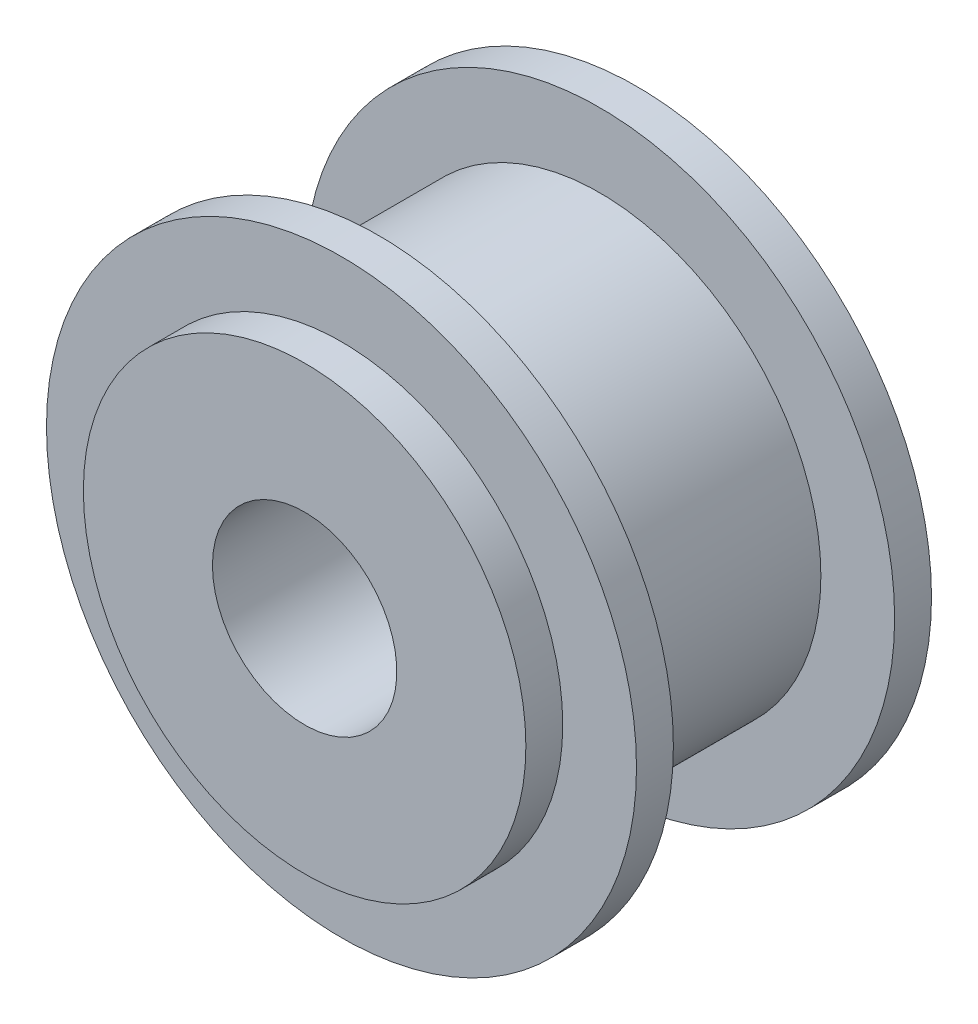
ISO-10303-21;
HEADER;
FILE_DESCRIPTION(('STEP AP214'),'2;1');
FILE_NAME('part.step','',(''),(''),'','','');
FILE_SCHEMA(('AUTOMOTIVE_DESIGN { 1 0 10303 214 1 1 1 1 }'));
ENDSEC;
DATA;
#1=APPLICATION_CONTEXT('core data for automotive mechanical design processes');
#2=APPLICATION_PROTOCOL_DEFINITION('international standard','automotive_design',2000,#1);
#3=PRODUCT_CONTEXT('',#1,'mechanical');
#4=PRODUCT('Part','Part','',(#3));
#5=PRODUCT_RELATED_PRODUCT_CATEGORY('part','',(#4));
#6=PRODUCT_DEFINITION_FORMATION('','',#4);
#7=PRODUCT_DEFINITION_CONTEXT('part definition',#1,'design');
#8=PRODUCT_DEFINITION('design','',#6,#7);
#9=PRODUCT_DEFINITION_SHAPE('','',#8);
#10=(LENGTH_UNIT() NAMED_UNIT(*) SI_UNIT(.MILLI.,.METRE.));
#11=(NAMED_UNIT(*) PLANE_ANGLE_UNIT() SI_UNIT($,.RADIAN.));
#12=(NAMED_UNIT(*) SI_UNIT($,.STERADIAN.) SOLID_ANGLE_UNIT());
#13=UNCERTAINTY_MEASURE_WITH_UNIT(LENGTH_MEASURE(1.E-05),#10,'distance_accuracy_value','');
#14=(GEOMETRIC_REPRESENTATION_CONTEXT(3) GLOBAL_UNCERTAINTY_ASSIGNED_CONTEXT((#13)) GLOBAL_UNIT_ASSIGNED_CONTEXT((#10,
#11,#12)) REPRESENTATION_CONTEXT('',''));
#15=CARTESIAN_POINT('',(0.,0.,0.));
#16=DIRECTION('',(0.,0.,1.));
#17=DIRECTION('',(1.,0.,0.));
#18=AXIS2_PLACEMENT_3D('',#15,#16,#17);
#19=CARTESIAN_POINT('',(-26.1172302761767,26.9098547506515,0.));
#20=DIRECTION('',(0.,0.,-1.));
#21=DIRECTION('',(-1.,0.,0.));
#22=AXIS2_PLACEMENT_3D('',#19,#20,#21);
#23=CYLINDRICAL_SURFACE('',#22,1.25);
#24=CARTESIAN_POINT('',(-26.1172302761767,26.9098547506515,0.));
#25=DIRECTION('',(0.,0.,-1.));
#26=DIRECTION('',(-1.,0.,0.));
#27=AXIS2_PLACEMENT_3D('',#24,#25,#26);
#28=CIRCLE('',#27,1.25);
#29=CARTESIAN_POINT('',(-27.3672302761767,26.9098547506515,0.));
#30=VERTEX_POINT('',#29);
#31=EDGE_CURVE('E406',#30,#30,#28,.T.);
#32=ORIENTED_EDGE('',*,*,#31,.T.);
#33=EDGE_LOOP('',(#32));
#34=FACE_BOUND('',#33,.T.);
#35=CARTESIAN_POINT('',(-26.1172302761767,26.9098547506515,4.99999999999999));
#36=DIRECTION('',(0.,0.,-1.));
#37=DIRECTION('',(-1.,0.,0.));
#38=AXIS2_PLACEMENT_3D('',#35,#36,#37);
#39=CIRCLE('',#38,1.25);
#40=CARTESIAN_POINT('',(-27.3672302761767,26.9098547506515,4.99999999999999));
#41=VERTEX_POINT('',#40);
#42=EDGE_CURVE('E10',#41,#41,#39,.T.);
#43=ORIENTED_EDGE('',*,*,#42,.F.);
#44=EDGE_LOOP('',(#43));
#45=FACE_BOUND('',#44,.T.);
#46=ADVANCED_FACE('F366',(#34,#45),#23,.F.);
#47=CARTESIAN_POINT('',(-26.9878046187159,27.8068499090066,4.99999999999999));
#48=DIRECTION('',(0.,0.,1.));
#49=DIRECTION('',(1.,0.,0.));
#50=AXIS2_PLACEMENT_3D('',#47,#48,#49);
#51=PLANE('',#50);
#52=ORIENTED_EDGE('',*,*,#42,.T.);
#53=EDGE_LOOP('',(#52));
#54=FACE_BOUND('',#53,.T.);
#55=CARTESIAN_POINT('',(-26.1172302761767,26.9098547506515,4.99999999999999));
#56=DIRECTION('',(0.,0.,-1.));
#57=DIRECTION('',(-1.,0.,0.));
#58=AXIS2_PLACEMENT_3D('',#55,#56,#57);
#59=CIRCLE('',#58,3.00000000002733);
#60=CARTESIAN_POINT('',(-29.117230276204,26.9098547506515,4.99999999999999));
#61=VERTEX_POINT('',#60);
#62=EDGE_CURVE('E372',#61,#61,#59,.T.);
#63=ORIENTED_EDGE('',*,*,#62,.F.);
#64=EDGE_LOOP('',(#63));
#65=FACE_BOUND('',#64,.T.);
#66=ADVANCED_FACE('F424',(#54,#65),#51,.T.);
#67=CARTESIAN_POINT('',(-26.1172302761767,26.9098547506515,0.));
#68=DIRECTION('',(0.,0.,-1.));
#69=DIRECTION('',(-1.,0.,0.));
#70=AXIS2_PLACEMENT_3D('',#67,#68,#69);
#71=CYLINDRICAL_SURFACE('',#70,3.00000000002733);
#72=ORIENTED_EDGE('',*,*,#62,.T.);
#73=EDGE_LOOP('',(#72));
#74=FACE_BOUND('',#73,.T.);
#75=CARTESIAN_POINT('',(-26.1172302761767,26.9098547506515,4.49999999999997));
#76=DIRECTION('',(0.,0.,-1.));
#77=DIRECTION('',(-1.,0.,0.));
#78=AXIS2_PLACEMENT_3D('',#75,#76,#77);
#79=CIRCLE('',#78,3.00000000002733);
#80=CARTESIAN_POINT('',(-29.117230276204,26.9098547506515,4.49999999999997));
#81=VERTEX_POINT('',#80);
#82=EDGE_CURVE('E376',#81,#81,#79,.T.);
#83=ORIENTED_EDGE('',*,*,#82,.F.);
#84=EDGE_LOOP('',(#83));
#85=FACE_BOUND('',#84,.T.);
#86=ADVANCED_FACE('F428',(#74,#85),#71,.T.);
#87=CARTESIAN_POINT('',(-28.2066086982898,29.0626431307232,4.49999999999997));
#88=DIRECTION('',(0.,0.,1.));
#89=DIRECTION('',(1.,0.,0.));
#90=AXIS2_PLACEMENT_3D('',#87,#88,#89);
#91=PLANE('',#90);
#92=ORIENTED_EDGE('',*,*,#82,.T.);
#93=EDGE_LOOP('',(#92));
#94=FACE_BOUND('',#93,.T.);
#95=CARTESIAN_POINT('',(-26.1172302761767,26.9098547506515,4.49999999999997));
#96=DIRECTION('',(0.,0.,-1.));
#97=DIRECTION('',(-1.,0.,0.));
#98=AXIS2_PLACEMENT_3D('',#95,#96,#97);
#99=CIRCLE('',#98,3.99999999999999);
#100=CARTESIAN_POINT('',(-30.1172302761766,26.9098547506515,4.49999999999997));
#101=VERTEX_POINT('',#100);
#102=EDGE_CURVE('E380',#101,#101,#99,.T.);
#103=ORIENTED_EDGE('',*,*,#102,.F.);
#104=EDGE_LOOP('',(#103));
#105=FACE_BOUND('',#104,.T.);
#106=ADVANCED_FACE('F432',(#94,#105),#91,.T.);
#107=CARTESIAN_POINT('',(-26.1172302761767,26.9098547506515,0.));
#108=DIRECTION('',(0.,0.,-1.));
#109=DIRECTION('',(-1.,0.,0.));
#110=AXIS2_PLACEMENT_3D('',#107,#108,#109);
#111=CYLINDRICAL_SURFACE('',#110,3.99999999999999);
#112=ORIENTED_EDGE('',*,*,#102,.T.);
#113=EDGE_LOOP('',(#112));
#114=FACE_BOUND('',#113,.T.);
#115=CARTESIAN_POINT('',(-26.1172302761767,26.9098547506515,3.99999999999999));
#116=DIRECTION('',(0.,0.,-1.));
#117=DIRECTION('',(-1.,0.,0.));
#118=AXIS2_PLACEMENT_3D('',#115,#116,#117);
#119=CIRCLE('',#118,3.99999999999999);
#120=CARTESIAN_POINT('',(-30.1172302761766,26.9098547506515,3.99999999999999));
#121=VERTEX_POINT('',#120);
#122=EDGE_CURVE('E385',#121,#121,#119,.T.);
#123=ORIENTED_EDGE('',*,*,#122,.F.);
#124=EDGE_LOOP('',(#123));
#125=FACE_BOUND('',#124,.T.);
#126=ADVANCED_FACE('F438',(#114,#125),#111,.T.);
#127=CARTESIAN_POINT('',(-28.9030681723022,29.7802392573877,3.99999999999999));
#128=DIRECTION('',(0.,0.,-1.));
#129=DIRECTION('',(-1.,0.,0.));
#130=AXIS2_PLACEMENT_3D('',#127,#128,#129);
#131=PLANE('',#130);
#132=ORIENTED_EDGE('',*,*,#122,.T.);
#133=EDGE_LOOP('',(#132));
#134=FACE_BOUND('',#133,.T.);
#135=CARTESIAN_POINT('',(-26.1172302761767,26.9098547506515,3.99999999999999));
#136=DIRECTION('',(0.,0.,-1.));
#137=DIRECTION('',(-1.,0.,0.));
#138=AXIS2_PLACEMENT_3D('',#135,#136,#137);
#139=CIRCLE('',#138,3.00000000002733);
#140=CARTESIAN_POINT('',(-29.117230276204,26.9098547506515,3.99999999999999));
#141=VERTEX_POINT('',#140);
#142=EDGE_CURVE('E388',#141,#141,#139,.T.);
#143=ORIENTED_EDGE('',*,*,#142,.F.);
#144=EDGE_LOOP('',(#143));
#145=FACE_BOUND('',#144,.T.);
#146=ADVANCED_FACE('F442',(#134,#145),#131,.T.);
#147=CARTESIAN_POINT('',(-26.1172302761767,26.9098547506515,0.));
#148=DIRECTION('',(0.,0.,-1.));
#149=DIRECTION('',(-1.,0.,0.));
#150=AXIS2_PLACEMENT_3D('',#147,#148,#149);
#151=CYLINDRICAL_SURFACE('',#150,3.00000000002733);
#152=ORIENTED_EDGE('',*,*,#142,.T.);
#153=EDGE_LOOP('',(#152));
#154=FACE_BOUND('',#153,.T.);
#155=CARTESIAN_POINT('',(-26.1172302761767,26.9098547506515,0.999999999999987));
#156=DIRECTION('',(0.,0.,-1.));
#157=DIRECTION('',(-1.,0.,0.));
#158=AXIS2_PLACEMENT_3D('',#155,#156,#157);
#159=CIRCLE('',#158,3.00000000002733);
#160=CARTESIAN_POINT('',(-29.117230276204,26.9098547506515,0.999999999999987));
#161=VERTEX_POINT('',#160);
#162=EDGE_CURVE('E391',#161,#161,#159,.T.);
#163=ORIENTED_EDGE('',*,*,#162,.F.);
#164=EDGE_LOOP('',(#163));
#165=FACE_BOUND('',#164,.T.);
#166=ADVANCED_FACE('F446',(#154,#165),#151,.T.);
#167=CARTESIAN_POINT('',(-28.9030681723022,29.7802392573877,0.999999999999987));
#168=DIRECTION('',(0.,0.,1.));
#169=DIRECTION('',(1.,0.,0.));
#170=AXIS2_PLACEMENT_3D('',#167,#168,#169);
#171=PLANE('',#170);
#172=ORIENTED_EDGE('',*,*,#162,.T.);
#173=EDGE_LOOP('',(#172));
#174=FACE_BOUND('',#173,.T.);
#175=CARTESIAN_POINT('',(-26.1172302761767,26.9098547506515,0.999999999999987));
#176=DIRECTION('',(0.,0.,-1.));
#177=DIRECTION('',(-1.,0.,0.));
#178=AXIS2_PLACEMENT_3D('',#175,#176,#177);
#179=CIRCLE('',#178,3.99999999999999);
#180=CARTESIAN_POINT('',(-30.1172302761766,26.9098547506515,0.999999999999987));
#181=VERTEX_POINT('',#180);
#182=EDGE_CURVE('E394',#181,#181,#179,.T.);
#183=ORIENTED_EDGE('',*,*,#182,.F.);
#184=EDGE_LOOP('',(#183));
#185=FACE_BOUND('',#184,.T.);
#186=ADVANCED_FACE('F450',(#174,#185),#171,.T.);
#187=CARTESIAN_POINT('',(-26.1172302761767,26.9098547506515,0.));
#188=DIRECTION('',(0.,0.,-1.));
#189=DIRECTION('',(-1.,0.,0.));
#190=AXIS2_PLACEMENT_3D('',#187,#188,#189);
#191=CYLINDRICAL_SURFACE('',#190,3.99999999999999);
#192=ORIENTED_EDGE('',*,*,#182,.T.);
#193=EDGE_LOOP('',(#192));
#194=FACE_BOUND('',#193,.T.);
#195=CARTESIAN_POINT('',(-26.1172302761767,26.9098547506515,0.499999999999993));
#196=DIRECTION('',(0.,0.,-1.));
#197=DIRECTION('',(-1.,0.,0.));
#198=AXIS2_PLACEMENT_3D('',#195,#196,#197);
#199=CIRCLE('',#198,3.99999999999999);
#200=CARTESIAN_POINT('',(-30.1172302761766,26.9098547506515,0.499999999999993));
#201=VERTEX_POINT('',#200);
#202=EDGE_CURVE('E397',#201,#201,#199,.T.);
#203=ORIENTED_EDGE('',*,*,#202,.F.);
#204=EDGE_LOOP('',(#203));
#205=FACE_BOUND('',#204,.T.);
#206=ADVANCED_FACE('F454',(#194,#205),#191,.T.);
#207=CARTESIAN_POINT('',(-28.2066086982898,29.0626431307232,0.5));
#208=DIRECTION('',(0.,0.,-1.));
#209=DIRECTION('',(-1.,0.,0.));
#210=AXIS2_PLACEMENT_3D('',#207,#208,#209);
#211=PLANE('',#210);
#212=ORIENTED_EDGE('',*,*,#202,.T.);
#213=EDGE_LOOP('',(#212));
#214=FACE_BOUND('',#213,.T.);
#215=CARTESIAN_POINT('',(-26.1172302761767,26.9098547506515,0.500000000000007));
#216=DIRECTION('',(0.,0.,-1.));
#217=DIRECTION('',(-1.,0.,0.));
#218=AXIS2_PLACEMENT_3D('',#215,#216,#217);
#219=CIRCLE('',#218,3.00000000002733);
#220=CARTESIAN_POINT('',(-29.117230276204,26.9098547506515,0.500000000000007));
#221=VERTEX_POINT('',#220);
#222=EDGE_CURVE('E400',#221,#221,#219,.T.);
#223=ORIENTED_EDGE('',*,*,#222,.F.);
#224=EDGE_LOOP('',(#223));
#225=FACE_BOUND('',#224,.T.);
#226=ADVANCED_FACE('F420',(#214,#225),#211,.T.);
#227=CARTESIAN_POINT('',(-26.1172302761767,26.9098547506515,0.));
#228=DIRECTION('',(0.,0.,-1.));
#229=DIRECTION('',(-1.,0.,0.));
#230=AXIS2_PLACEMENT_3D('',#227,#228,#229);
#231=CYLINDRICAL_SURFACE('',#230,3.00000000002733);
#232=ORIENTED_EDGE('',*,*,#222,.T.);
#233=EDGE_LOOP('',(#232));
#234=FACE_BOUND('',#233,.T.);
#235=CARTESIAN_POINT('',(-26.1172302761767,26.9098547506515,0.));
#236=DIRECTION('',(0.,0.,-1.));
#237=DIRECTION('',(-1.,0.,0.));
#238=AXIS2_PLACEMENT_3D('',#235,#236,#237);
#239=CIRCLE('',#238,3.00000000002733);
#240=CARTESIAN_POINT('',(-29.117230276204,26.9098547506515,0.));
#241=VERTEX_POINT('',#240);
#242=EDGE_CURVE('E403',#241,#241,#239,.T.);
#243=ORIENTED_EDGE('',*,*,#242,.F.);
#244=EDGE_LOOP('',(#243));
#245=FACE_BOUND('',#244,.T.);
#246=ADVANCED_FACE('F414',(#234,#245),#231,.T.);
#247=CARTESIAN_POINT('',(-26.9878046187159,27.8068499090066,0.));
#248=DIRECTION('',(0.,0.,-1.));
#249=DIRECTION('',(-1.,0.,0.));
#250=AXIS2_PLACEMENT_3D('',#247,#248,#249);
#251=PLANE('',#250);
#252=ORIENTED_EDGE('',*,*,#242,.T.);
#253=EDGE_LOOP('',(#252));
#254=FACE_BOUND('',#253,.T.);
#255=ORIENTED_EDGE('',*,*,#31,.F.);
#256=EDGE_LOOP('',(#255));
#257=FACE_BOUND('',#256,.T.);
#258=ADVANCED_FACE('F412',(#254,#257),#251,.T.);
#259=CLOSED_SHELL('',(#46,#66,#86,#106,#126,#146,#166,#186,#206,#226,#246,#258));
#260=MANIFOLD_SOLID_BREP('B2',#259);
#261=ADVANCED_BREP_SHAPE_REPRESENTATION('',(#18,#260),#14);
#262=SHAPE_DEFINITION_REPRESENTATION(#9,#261);
ENDSEC;
END-ISO-10303-21;
